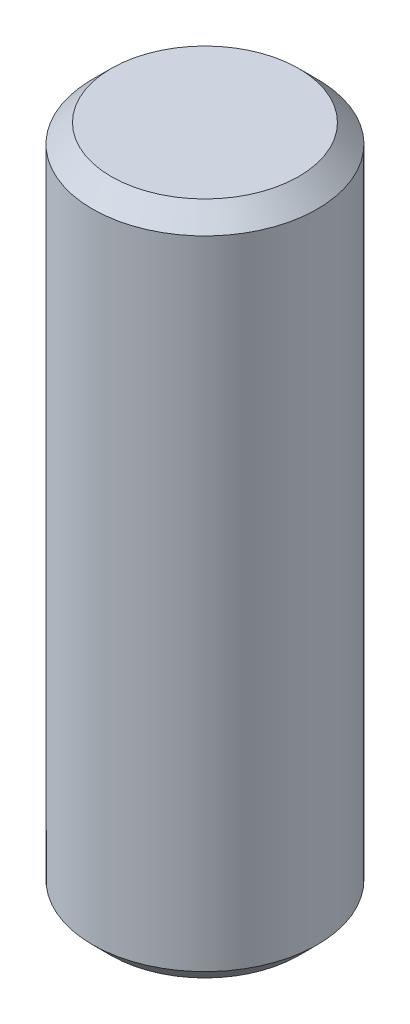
ISO-10303-21;
HEADER;
FILE_DESCRIPTION(('STEP AP214'),'2;1');
FILE_NAME('part.step','',(''),(''),'','','');
FILE_SCHEMA(('AUTOMOTIVE_DESIGN { 1 0 10303 214 1 1 1 1 }'));
ENDSEC;
DATA;
#1=APPLICATION_CONTEXT('core data for automotive mechanical design processes');
#2=APPLICATION_PROTOCOL_DEFINITION('international standard','automotive_design',2000,#1);
#3=PRODUCT_CONTEXT('',#1,'mechanical');
#4=PRODUCT('Part','Part','',(#3));
#5=PRODUCT_RELATED_PRODUCT_CATEGORY('part','',(#4));
#6=PRODUCT_DEFINITION_FORMATION('','',#4);
#7=PRODUCT_DEFINITION_CONTEXT('part definition',#1,'design');
#8=PRODUCT_DEFINITION('design','',#6,#7);
#9=PRODUCT_DEFINITION_SHAPE('','',#8);
#10=(LENGTH_UNIT() NAMED_UNIT(*) SI_UNIT(.MILLI.,.METRE.));
#11=(NAMED_UNIT(*) PLANE_ANGLE_UNIT() SI_UNIT($,.RADIAN.));
#12=(NAMED_UNIT(*) SI_UNIT($,.STERADIAN.) SOLID_ANGLE_UNIT());
#13=UNCERTAINTY_MEASURE_WITH_UNIT(LENGTH_MEASURE(1.E-05),#10,'distance_accuracy_value','');
#14=(GEOMETRIC_REPRESENTATION_CONTEXT(3) GLOBAL_UNCERTAINTY_ASSIGNED_CONTEXT((#13)) GLOBAL_UNIT_ASSIGNED_CONTEXT((#10,
#11,#12)) REPRESENTATION_CONTEXT('',''));
#15=CARTESIAN_POINT('',(0.,0.,0.));
#16=DIRECTION('',(0.,0.,1.));
#17=DIRECTION('',(1.,0.,0.));
#18=AXIS2_PLACEMENT_3D('',#15,#16,#17);
#19=CARTESIAN_POINT('',(0.,18.,0.));
#20=DIRECTION('',(0.,-1.,0.));
#21=DIRECTION('',(0.,0.,-1.));
#22=AXIS2_PLACEMENT_3D('',#19,#20,#21);
#23=CYLINDRICAL_SURFACE('',#22,3.);
#24=CARTESIAN_POINT('',(0.,0.499999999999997,0.));
#25=DIRECTION('',(0.,1.,0.));
#26=DIRECTION('',(0.,0.,1.));
#27=AXIS2_PLACEMENT_3D('',#24,#25,#26);
#28=CIRCLE('',#27,3.);
#29=CARTESIAN_POINT('',(0.,0.499999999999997,3.));
#30=VERTEX_POINT('',#29);
#31=EDGE_CURVE('E40',#30,#30,#28,.T.);
#32=ORIENTED_EDGE('',*,*,#31,.T.);
#33=EDGE_LOOP('',(#32));
#34=FACE_BOUND('',#33,.T.);
#35=CARTESIAN_POINT('',(0.,17.5,0.));
#36=DIRECTION('',(0.,1.,0.));
#37=DIRECTION('',(0.,0.,1.));
#38=AXIS2_PLACEMENT_3D('',#35,#36,#37);
#39=CIRCLE('',#38,3.);
#40=CARTESIAN_POINT('',(0.,17.5,3.));
#41=VERTEX_POINT('',#40);
#42=EDGE_CURVE('E44',#41,#41,#39,.F.);
#43=ORIENTED_EDGE('',*,*,#42,.T.);
#44=EDGE_LOOP('',(#43));
#45=FACE_BOUND('',#44,.T.);
#46=ADVANCED_FACE('F29',(#34,#45),#23,.T.);
#47=CARTESIAN_POINT('',(0.,18.,0.));
#48=DIRECTION('',(0.,1.,0.));
#49=DIRECTION('',(0.,0.,1.));
#50=AXIS2_PLACEMENT_3D('',#47,#48,#49);
#51=PLANE('',#50);
#52=CARTESIAN_POINT('',(0.,18.,0.));
#53=DIRECTION('',(0.,1.,0.));
#54=DIRECTION('',(0.,0.,1.));
#55=AXIS2_PLACEMENT_3D('',#52,#53,#54);
#56=CIRCLE('',#55,2.5);
#57=CARTESIAN_POINT('',(0.,18.,2.5));
#58=VERTEX_POINT('',#57);
#59=EDGE_CURVE('E10',#58,#58,#56,.T.);
#60=ORIENTED_EDGE('',*,*,#59,.T.);
#61=EDGE_LOOP('',(#60));
#62=FACE_BOUND('',#61,.T.);
#63=ADVANCED_FACE('F60',(#62),#51,.T.);
#64=CARTESIAN_POINT('',(0.,0.,0.));
#65=DIRECTION('',(0.,1.,0.));
#66=DIRECTION('',(0.,0.,1.));
#67=AXIS2_PLACEMENT_3D('',#64,#65,#66);
#68=PLANE('',#67);
#69=CARTESIAN_POINT('',(0.,0.,0.));
#70=DIRECTION('',(0.,1.,0.));
#71=DIRECTION('',(0.,0.,1.));
#72=AXIS2_PLACEMENT_3D('',#69,#70,#71);
#73=CIRCLE('',#72,2.5);
#74=CARTESIAN_POINT('',(0.,0.,2.5));
#75=VERTEX_POINT('',#74);
#76=EDGE_CURVE('E36',#75,#75,#73,.F.);
#77=ORIENTED_EDGE('',*,*,#76,.T.);
#78=EDGE_LOOP('',(#77));
#79=FACE_BOUND('',#78,.T.);
#80=ADVANCED_FACE('F57',(#79),#68,.F.);
#81=CARTESIAN_POINT('',(0.,0.499999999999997,0.));
#82=DIRECTION('',(0.,1.,0.));
#83=DIRECTION('',(0.,0.,1.));
#84=AXIS2_PLACEMENT_3D('',#81,#82,#83);
#85=CONICAL_SURFACE('',#84,3.,0.785398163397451);
#86=ORIENTED_EDGE('',*,*,#76,.F.);
#87=EDGE_LOOP('',(#86));
#88=FACE_BOUND('',#87,.T.);
#89=ORIENTED_EDGE('',*,*,#31,.F.);
#90=EDGE_LOOP('',(#89));
#91=FACE_BOUND('',#90,.T.);
#92=ADVANCED_FACE('F53',(#88,#91),#85,.T.);
#93=CARTESIAN_POINT('',(0.,18.,0.));
#94=DIRECTION('',(0.,-1.,0.));
#95=DIRECTION('',(0.,0.,-1.));
#96=AXIS2_PLACEMENT_3D('',#93,#94,#95);
#97=CONICAL_SURFACE('',#96,2.5,0.78539816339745);
#98=ORIENTED_EDGE('',*,*,#42,.F.);
#99=EDGE_LOOP('',(#98));
#100=FACE_BOUND('',#99,.T.);
#101=ORIENTED_EDGE('',*,*,#59,.F.);
#102=EDGE_LOOP('',(#101));
#103=FACE_BOUND('',#102,.T.);
#104=ADVANCED_FACE('F31',(#100,#103),#97,.T.);
#105=CLOSED_SHELL('',(#46,#63,#80,#92,#104));
#106=MANIFOLD_SOLID_BREP('B2',#105);
#107=ADVANCED_BREP_SHAPE_REPRESENTATION('',(#18,#106),#14);
#108=SHAPE_DEFINITION_REPRESENTATION(#9,#107);
ENDSEC;
END-ISO-10303-21;
